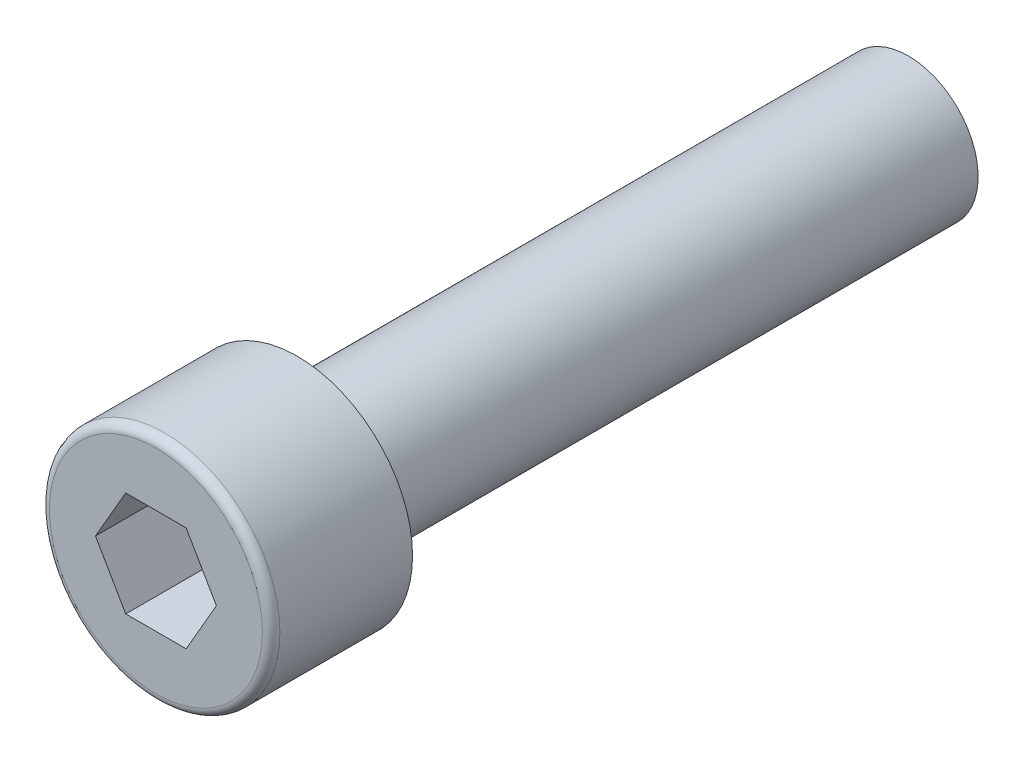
from build123d import *

# Parameters (mm, degrees)
SKETCH_1_R          = 6.6
EXTRUDE_1_DEPTH     = 8.1
SKETCH_2_R          = 4
EXTRUDE_2_DEPTH     = 35
CUT_EXTRUDE_1_DEPTH = 4.5
FILLET_1_R          = 0.5


with BuildPart() as part:
    # Sketch 1 → Extrude 1 (new body)
    with BuildSketch(Plane.XY):
        Circle(SKETCH_1_R)
    extrude(amount=-EXTRUDE_1_DEPTH)

    # Sketch 2 → Extrude 2 (add)
    with BuildSketch(Plane(origin=(0, 0, -8.1), x_dir=(-1, 0, 0), z_dir=(0, 0, -1))):
        Circle(SKETCH_2_R)
    extrude(amount=EXTRUDE_2_DEPTH)

    # Sketch 3 → Cut-Extrude 1 (cut)
    with BuildSketch(Plane.XY):
        Polygon((3.464101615, 0), (1.732050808, 3), (-1.732050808, 3), (-3.464101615, 0), (-1.732050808, -3), (1.732050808, -3), align=None)
    extrude(amount=-CUT_EXTRUDE_1_DEPTH, mode=Mode.SUBTRACT)

    # Fillet 1
    fillet_1_edges = [part.edges().sort_by_distance(p)[0] for p in [
        (-6.6, 0, 0),
    ]]
    fillet(fillet_1_edges, radius=FILLET_1_R)


solid = part.part
